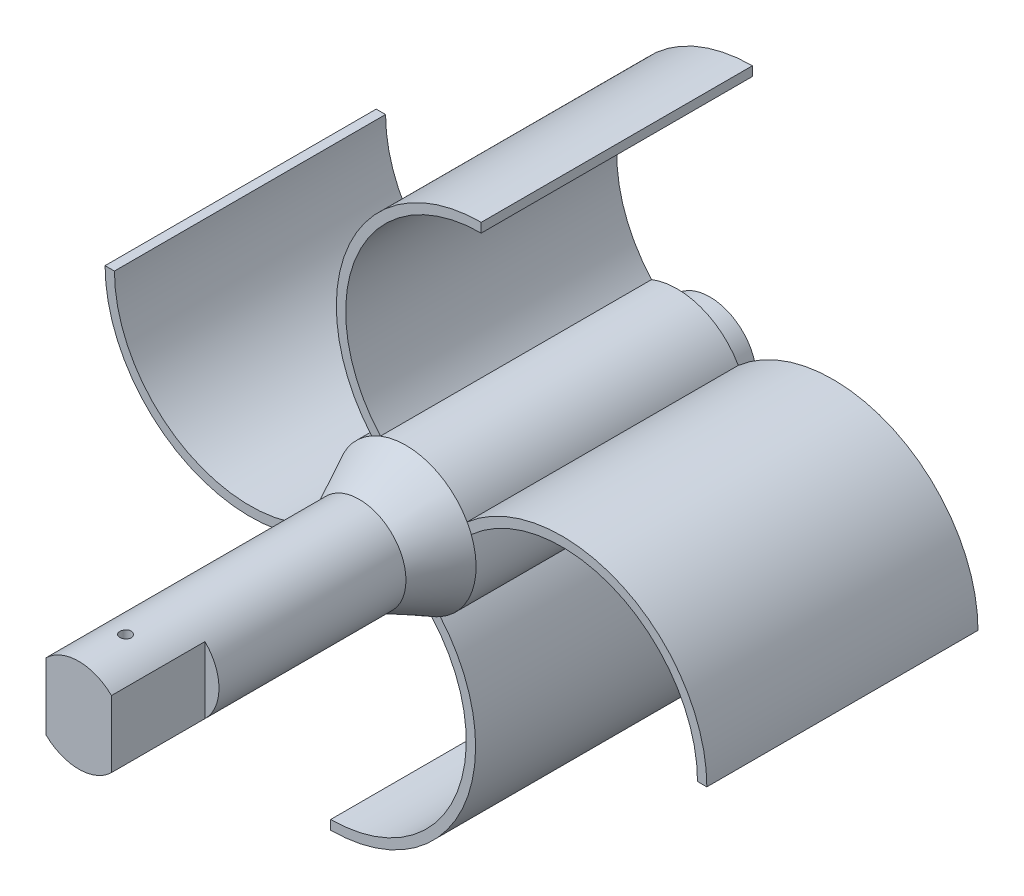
from build123d import *

# Parameters (mm, degrees)
EXTRUSION1_DEPTH        = 58
ESQUISSE4_R             = 10
EXTRUSION3_DEPTH        = 7
ESQUISSE7_R             = 15
ESQUISSE6_R             = 10
EXTRUSION4_START        = 60
ESQUISSE8_R             = 10
EXTRUSION4_DEPTH        = 60
ESQUISSE9_OUTSIDE_W     = 176.054
ESQUISSE9_OUTSIDE_H     = 176.054
ESQUISSE9_OUTSIDE_W_2   = 14
ESQUISSE9_OUTSIDE_H_2   = 23.295212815
ENL_V_MAT_EXTRU_1_DEPTH = 20
D_GAGEMENT_M21_D        = 2.4


with BuildPart() as part:
    # Esquisse2 → Extrusion1 (new body)
    with BuildSketch(Plane.XY):
        with BuildLine():
            Line((-64.363334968, 16.10263382), (-62.363334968, 16.10263382))
            ThreePointArc((-62.363334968, 16.10263382), (-45.166382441, -10.386761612), (-13.971054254, -5.459820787))
            ThreePointArc((-13.971054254, -5.459820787), (-14.124158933, 5.050557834), (-7.341265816, 13.080742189))
            ThreePointArc((-7.341265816, 13.080742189), (-12.090985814, 46.252082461), (16.10263382, 64.363334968))
            Line((16.10263382, 64.363334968), (16.10263382, 62.363334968))
            ThreePointArc((16.10263382, 62.363334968), (-10.386761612, 45.166382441), (-5.459820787, 13.971054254))
            ThreePointArc((-5.459820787, 13.971054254), (5.050557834, 14.124158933), (13.080742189, 7.341265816))
            ThreePointArc((13.080742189, 7.341265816), (46.252082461, 12.090985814), (64.363334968, -16.10263382))
            Line((64.363334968, -16.10263382), (62.363334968, -16.10263382))
            ThreePointArc((62.363334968, -16.10263382), (45.166382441, 10.386761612), (13.971054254, 5.459820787))
            ThreePointArc((13.971054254, 5.459820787), (14.124158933, -5.050557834), (7.341265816, -13.080742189))
            ThreePointArc((7.341265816, -13.080742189), (12.090985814, -46.252082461), (-16.10263382, -64.363334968))
            Line((-16.10263382, -64.363334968), (-16.10263382, -62.363334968))
            ThreePointArc((-16.10263382, -62.363334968), (10.386761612, -45.166382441), (5.459820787, -13.971054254))
            ThreePointArc((5.459820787, -13.971054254), (-5.050557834, -14.124158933), (-13.080742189, -7.341265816))
            ThreePointArc((-13.080742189, -7.341265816), (-46.252082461, -12.090985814), (-64.363334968, 16.10263382))
        make_face()
    extrude(amount=EXTRUSION1_DEPTH)

    # Esquisse4 → Extrusion3 (add)
    with BuildSketch(Plane(origin=(0, 0, 0), x_dir=(-1, 0, 0), z_dir=(0, 0, -1))):
        with Locations(Location((0, 0, 0), (0, 0, 180))):
            Circle(ESQUISSE4_R)
    extrude(amount=EXTRUSION3_DEPTH)

    # Esquisse7 → Lissage1 section 0
    with BuildSketch(Plane.XY.offset(58)):
        Circle(ESQUISSE7_R)
    # Esquisse6 → Lissage1 section 1
    with BuildSketch(Plane.XY.offset(68)):
        Circle(ESQUISSE6_R)
    loft()

    # Esquisse8 → Extrusion4 (add)
    with BuildSketch(Plane.XY.offset(68).offset(EXTRUSION4_START)):
        Circle(ESQUISSE8_R)
    extrude(amount=-EXTRUSION4_DEPTH)

    # Esquisse9 outside → Enl_v. mat.-Extru.1 (cut)
    with BuildSketch(Plane.XY.offset(128)):
        Rectangle(ESQUISSE9_OUTSIDE_W, ESQUISSE9_OUTSIDE_H)
        with Locations((0, 0.881868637)):
            Rectangle(ESQUISSE9_OUTSIDE_W_2, ESQUISSE9_OUTSIDE_H_2, mode=Mode.SUBTRACT)
    extrude(amount=-ENL_V_MAT_EXTRU_1_DEPTH, mode=Mode.SUBTRACT)

    # D_gagement M21 (through all)
    with Locations(Plane(origin=(0, 10, 0), x_dir=(-1, 0, 0), z_dir=(0, 1, 0))):
        with Locations((0, 118)):
            Hole(D_GAGEMENT_M21_D / 2)


solid = part.part
